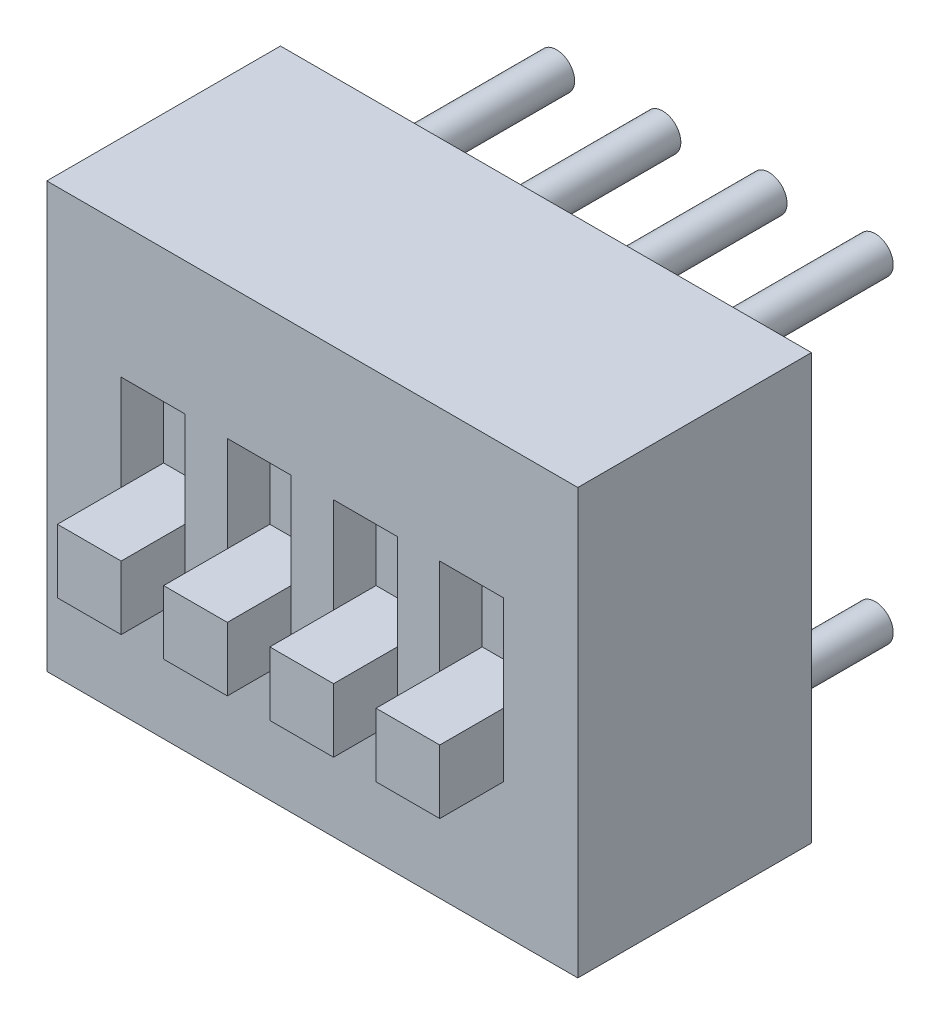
from build123d import *

# Parameters (mm, degrees)
SKETCH1_W             = 12.7
SKETCH1_H             = 10.16
BOSS_EXTRUDE1_DEPTH   = 5.588
SKETCH2_W             = 1.524
SKETCH2_H             = 3.81
CUT_EXTRUDE1_DEPTH    = 1.016
SKETCH3_W             = 1.524
SKETCH3_H             = 1.524
BOSS_EXTRUDE2_DEPTH   = 2.54
BOSS_EXTRUDE2_2_DEPTH = 2.54
BOSS_EXTRUDE2_3_DEPTH = 2.54
BOSS_EXTRUDE2_4_DEPTH = 2.54
SKETCH4_R             = 0.4318
BOSS_EXTRUDE3_DEPTH   = 4.064
BOSS_EXTRUDE3_2_DEPTH = 4.064
BOSS_EXTRUDE3_3_DEPTH = 4.064
BOSS_EXTRUDE3_4_DEPTH = 4.064
BOSS_EXTRUDE3_5_DEPTH = 4.064
BOSS_EXTRUDE3_6_DEPTH = 4.064
BOSS_EXTRUDE3_7_DEPTH = 4.064
BOSS_EXTRUDE3_8_DEPTH = 4.064


with BuildPart() as part:
    # Sketch1 → Boss-Extrude1 (new body)
    with BuildSketch(Plane.XY):
        with Locations((3.81, 0)):
            Rectangle(SKETCH1_W, SKETCH1_H)
    extrude(amount=BOSS_EXTRUDE1_DEPTH)

    # Sketch2 → Cut-Extrude1 (cut)
    with BuildSketch(Plane.XY.offset(5.588)):
        Rectangle(SKETCH2_W, SKETCH2_H)
        with Locations((2.54, 0)):
            Rectangle(SKETCH2_W, SKETCH2_H)
        with Locations((5.08, 0)):
            Rectangle(SKETCH2_W, SKETCH2_H)
        with Locations((7.62, 0)):
            Rectangle(SKETCH2_W, SKETCH2_H)
    extrude(amount=-CUT_EXTRUDE1_DEPTH, mode=Mode.SUBTRACT)


with BuildPart() as body_2:
    # Sketch3 → Boss-Extrude2 (new body)
    with BuildSketch(Plane.XY.offset(4.572)):
        with Locations((0, -1.143)):
            Rectangle(SKETCH3_W, SKETCH3_H)
    extrude(amount=BOSS_EXTRUDE2_DEPTH)


with BuildPart() as body_3:
    # Sketch3 → Boss-Extrude2 2 (new body)
    with BuildSketch(Plane.XY.offset(4.572)):
        with Locations((2.54, -1.143)):
            Rectangle(SKETCH3_W, SKETCH3_H)
    extrude(amount=BOSS_EXTRUDE2_2_DEPTH)


with BuildPart() as body_4:
    # Sketch3 → Boss-Extrude2 3 (new body)
    with BuildSketch(Plane.XY.offset(4.572)):
        with Locations((5.08, -1.143)):
            Rectangle(SKETCH3_W, SKETCH3_H)
    extrude(amount=BOSS_EXTRUDE2_3_DEPTH)


with BuildPart() as body_5:
    # Sketch3 → Boss-Extrude2 4 (new body)
    with BuildSketch(Plane.XY.offset(4.572)):
        with Locations((7.62, -1.143)):
            Rectangle(SKETCH3_W, SKETCH3_H)
    extrude(amount=BOSS_EXTRUDE2_4_DEPTH)


with BuildPart() as body_6:
    # Sketch4 → Boss-Extrude3 (new body)
    with BuildSketch(Plane(origin=(0, 0, 0), x_dir=(-1, 0, 0), z_dir=(0, 0, -1))):
        with Locations((0, 3.81)):
            Circle(SKETCH4_R)
    extrude(amount=BOSS_EXTRUDE3_DEPTH)


with BuildPart() as body_7:
    # Sketch4 → Boss-Extrude3 2 (new body)
    with BuildSketch(Plane(origin=(0, 0, 0), x_dir=(-1, 0, 0), z_dir=(0, 0, -1))):
        with Locations((0, -3.81)):
            Circle(SKETCH4_R)
    extrude(amount=BOSS_EXTRUDE3_2_DEPTH)


with BuildPart() as body_8:
    # Sketch4 → Boss-Extrude3 3 (new body)
    with BuildSketch(Plane(origin=(0, 0, 0), x_dir=(-1, 0, 0), z_dir=(0, 0, -1))):
        with Locations((-2.54, -3.81)):
            Circle(SKETCH4_R)
    extrude(amount=BOSS_EXTRUDE3_3_DEPTH)


with BuildPart() as body_9:
    # Sketch4 → Boss-Extrude3 4 (new body)
    with BuildSketch(Plane(origin=(0, 0, 0), x_dir=(-1, 0, 0), z_dir=(0, 0, -1))):
        with Locations((-5.08, -3.81)):
            Circle(SKETCH4_R)
    extrude(amount=BOSS_EXTRUDE3_4_DEPTH)


with BuildPart() as body_10:
    # Sketch4 → Boss-Extrude3 5 (new body)
    with BuildSketch(Plane(origin=(0, 0, 0), x_dir=(-1, 0, 0), z_dir=(0, 0, -1))):
        with Locations((-7.62, -3.81)):
            Circle(SKETCH4_R)
    extrude(amount=BOSS_EXTRUDE3_5_DEPTH)


with BuildPart() as body_11:
    # Sketch4 → Boss-Extrude3 6 (new body)
    with BuildSketch(Plane(origin=(0, 0, 0), x_dir=(-1, 0, 0), z_dir=(0, 0, -1))):
        with Locations((-2.54, 3.81)):
            Circle(SKETCH4_R)
    extrude(amount=BOSS_EXTRUDE3_6_DEPTH)


with BuildPart() as body_12:
    # Sketch4 → Boss-Extrude3 7 (new body)
    with BuildSketch(Plane(origin=(0, 0, 0), x_dir=(-1, 0, 0), z_dir=(0, 0, -1))):
        with Locations((-5.08, 3.81)):
            Circle(SKETCH4_R)
    extrude(amount=BOSS_EXTRUDE3_7_DEPTH)


with BuildPart() as body_13:
    # Sketch4 → Boss-Extrude3 8 (new body)
    with BuildSketch(Plane(origin=(0, 0, 0), x_dir=(-1, 0, 0), z_dir=(0, 0, -1))):
        with Locations((-7.62, 3.81)):
            Circle(SKETCH4_R)
    extrude(amount=BOSS_EXTRUDE3_8_DEPTH)


solid = Compound([part.part, body_2.part, body_3.part, body_4.part, body_5.part, body_6.part, body_7.part, body_8.part, body_9.part, body_10.part, body_11.part, body_12.part, body_13.part])
